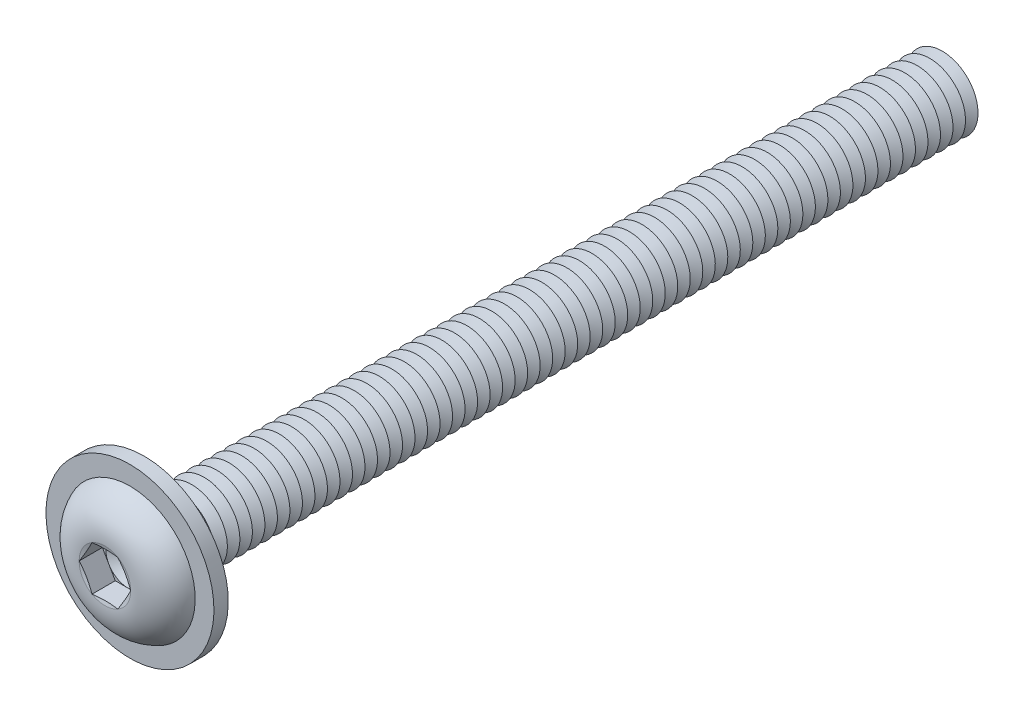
from build123d import *

# Parameters (mm, degrees)
FILLET1_R           = 0.35
LPATTERN1_COUNT     = 64
LPATTERN1_PITCH     = 0.7
CUT_EXTRUDE1_DEPTH  = 1.3
SKETCH5_R           = 4.7
SKETCH5_R_2         = 2.35
BOSS_EXTRUDE1_DEPTH = 0.8


with BuildPart() as part:
    # Sketch1 → Revolve1 (revolve)
    with BuildSketch(Plane(origin=(0, 0, 0), x_dir=(0, 0, -1), z_dir=(1, 0, 0))):
        with BuildLine():
            Line((0, 2), (0, 3.8))
            ThreePointArc((0, 3.8), (-1.611961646, 3.099623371), (-2.2, 1.443375))
            Line((-2.2, 1.443375), (-2.006624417, 0.7216875))
            Line((-2.006624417, 0.7216875), (-2.2, 0.7216875))
            Line((-2.2, 0.7216875), (-2.2, 0))
            Line((-2.2, 0), (45, 0))
            Line((45, 0), (45, 2))
            Line((45, 2), (0, 2))
        make_face()
    revolve(axis=Axis((0, 0, -45), (0, 0, 1)))

    # Fillet1
    fillet1_edges = [part.edges().sort_by_distance(p)[0] for p in [
        (0, -2, 0),
    ]]
    fillet(fillet1_edges, radius=FILLET1_R)

    # Sketch2 → Cut-Revolve1 (revolve, cut)
    with BuildSketch(Plane(origin=(0, 0, 0), x_dir=(0, 0, -1), z_dir=(1, 0, 0))):
        Polygon((44.65, 2), (45.35, 2), (45, 1.393782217), align=None)
    cut_revolve1 = revolve(axis=Axis((0, 0, -45), (0, 0, -1)), mode=Mode.SUBTRACT)

    # LPattern1: Cut-Revolve1 ×64
    with Locations(*[(0, 0, i * LPATTERN1_PITCH) for i in range(1, LPATTERN1_COUNT)]):
        add(cut_revolve1, mode=Mode.SUBTRACT)

    # Sketch3 → Cut-Extrude1 (cut)
    with BuildSketch(Plane.XY.offset(2.2)):
        Polygon((0.7216875, 1.249999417), (-0.7216875, 1.249999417), (-1.443375, 0), (-0.7216875, -1.249999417), (0.7216875, -1.249999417), (1.443375, 0), align=None)
    extrude(amount=-CUT_EXTRUDE1_DEPTH, mode=Mode.SUBTRACT)

    # Cut-Extrude2 cone 1 section (on through the dimple's axis) → Cut-Extrude2 (revolve, cut)
    with BuildSketch(Plane(origin=(0, 0, 0.9), x_dir=(0, -1, 0), z_dir=(1, 0, 0))):
        Polygon((0, 0), (1.249999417, 0), (0, 0.7216875), align=None)
    revolve(axis=Axis((0, 0, 0.9), (0, 0, -1)), mode=Mode.SUBTRACT)

    # Sketch5 → Boss-Extrude1 (add)
    with BuildSketch(Plane(origin=(0, 0, 0), x_dir=(-1, 0, 0), z_dir=(0, 0, -1))):
        with Locations(Location((0, 0, 0), (0, 0, 90))):
            Circle(SKETCH5_R)
        Circle(SKETCH5_R_2, mode=Mode.SUBTRACT)
    extrude(amount=-BOSS_EXTRUDE1_DEPTH)


solid = part.part
